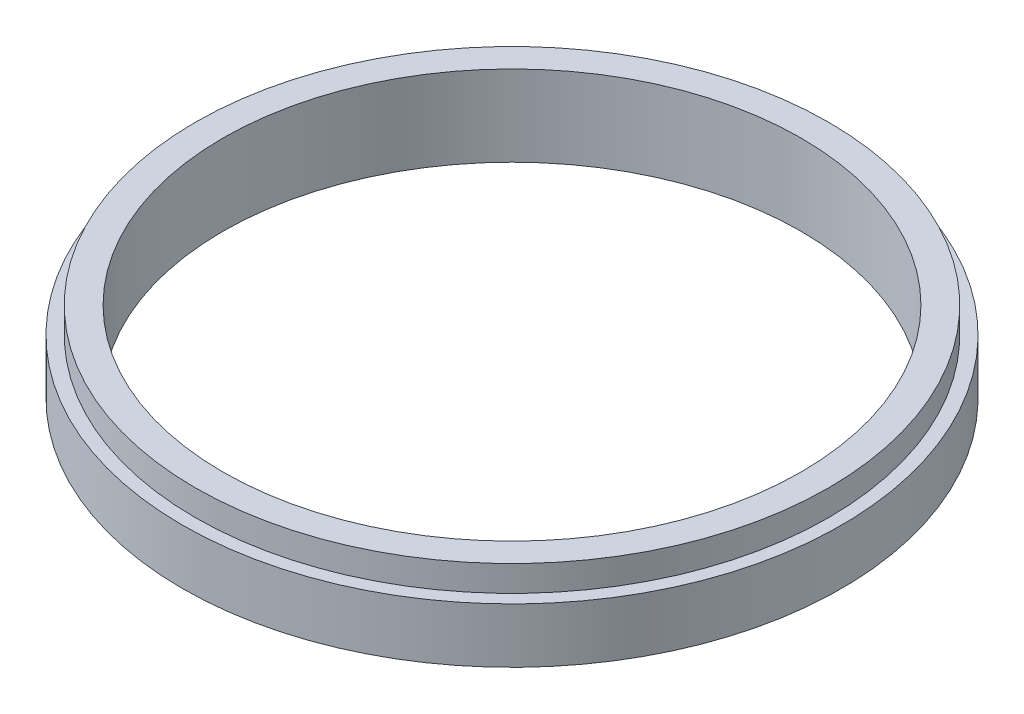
from build123d import *

# Parameters (mm, degrees)
SKETCH1_R           = 25.5
BOSS_EXTRUDE1_DEPTH = 4.25
SKETCH2_R           = 24.5
BOSS_EXTRUDE2_DEPTH = 2
SKETCH3_R           = 22.375
CUT_EXTRUDE1_DEPTH  = 37.600034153


with BuildPart() as part:
    # Sketch1 → Boss-Extrude1 (new body)
    with BuildSketch(Plane(origin=(0, 0, 0), x_dir=(1, 0, 0), z_dir=(0, 1, 0))):
        with Locations(Location((0, 0, 0), (0, 0, 270))):
            Circle(SKETCH1_R)
    extrude(amount=BOSS_EXTRUDE1_DEPTH)

    # Sketch2 → Boss-Extrude2 (add)
    with BuildSketch(Plane(origin=(0, 4.25, 0), x_dir=(1, 0, 0), z_dir=(0, 1, 0))):
        with Locations(Location((0, 0, 0), (0, 0, 270))):
            Circle(SKETCH2_R)
    extrude(amount=BOSS_EXTRUDE2_DEPTH)

    # Sketch3 → Cut-Extrude1 (cut, through all)
    with BuildSketch(Plane.XZ):
        with Locations(Location((0, 0, 0), (0, 0, 270))):
            Circle(SKETCH3_R)
    extrude(amount=-CUT_EXTRUDE1_DEPTH, mode=Mode.SUBTRACT)


solid = part.part
